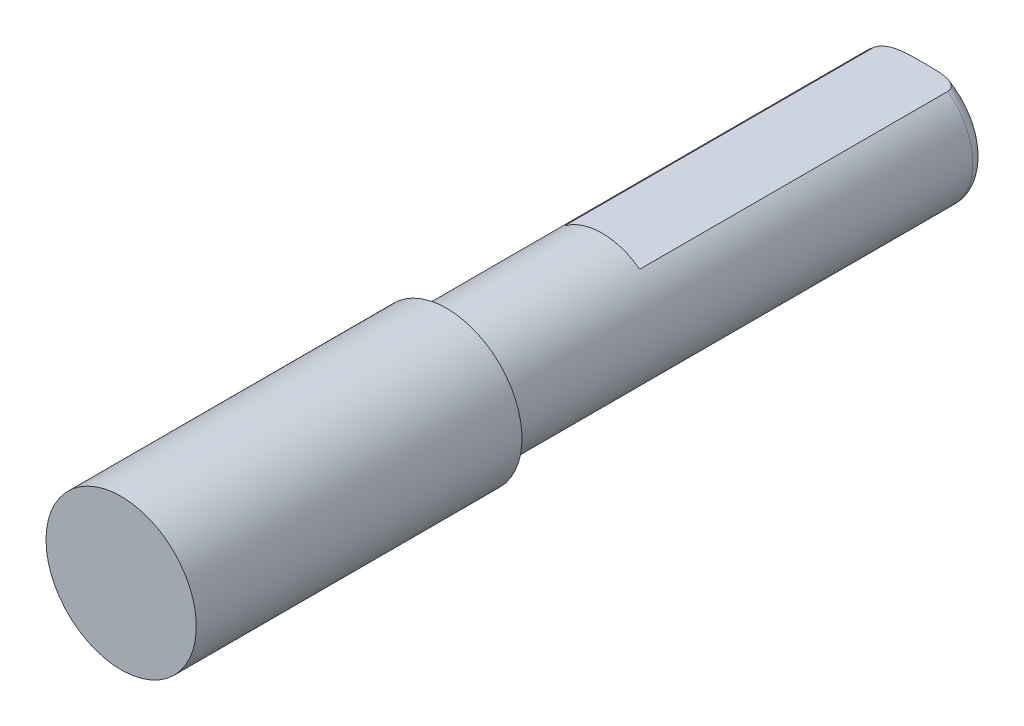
ISO-10303-21;
HEADER;
FILE_DESCRIPTION(('STEP AP214'),'2;1');
FILE_NAME('part.step','',(''),(''),'','','');
FILE_SCHEMA(('AUTOMOTIVE_DESIGN { 1 0 10303 214 1 1 1 1 }'));
ENDSEC;
DATA;
#1=APPLICATION_CONTEXT('core data for automotive mechanical design processes');
#2=APPLICATION_PROTOCOL_DEFINITION('international standard','automotive_design',2000,#1);
#3=PRODUCT_CONTEXT('',#1,'mechanical');
#4=PRODUCT('Part','Part','',(#3));
#5=PRODUCT_RELATED_PRODUCT_CATEGORY('part','',(#4));
#6=PRODUCT_DEFINITION_FORMATION('','',#4);
#7=PRODUCT_DEFINITION_CONTEXT('part definition',#1,'design');
#8=PRODUCT_DEFINITION('design','',#6,#7);
#9=PRODUCT_DEFINITION_SHAPE('','',#8);
#10=(LENGTH_UNIT() NAMED_UNIT(*) SI_UNIT(.MILLI.,.METRE.));
#11=(NAMED_UNIT(*) PLANE_ANGLE_UNIT() SI_UNIT($,.RADIAN.));
#12=(NAMED_UNIT(*) SI_UNIT($,.STERADIAN.) SOLID_ANGLE_UNIT());
#13=UNCERTAINTY_MEASURE_WITH_UNIT(LENGTH_MEASURE(1.E-05),#10,'distance_accuracy_value','');
#14=(GEOMETRIC_REPRESENTATION_CONTEXT(3) GLOBAL_UNCERTAINTY_ASSIGNED_CONTEXT((#13)) GLOBAL_UNIT_ASSIGNED_CONTEXT((#10,
#11,#12)) REPRESENTATION_CONTEXT('',''));
#15=CARTESIAN_POINT('',(0.,0.,0.));
#16=DIRECTION('',(0.,0.,1.));
#17=DIRECTION('',(1.,0.,0.));
#18=AXIS2_PLACEMENT_3D('',#15,#16,#17);
#19=CARTESIAN_POINT('',(0.,0.,19.));
#20=DIRECTION('',(0.,0.,-1.));
#21=DIRECTION('',(-1.,0.,0.));
#22=AXIS2_PLACEMENT_3D('',#19,#20,#21);
#23=CYLINDRICAL_SURFACE('',#22,2.5);
#24=CARTESIAN_POINT('',(0.,0.,19.));
#25=DIRECTION('',(0.,0.,1.));
#26=DIRECTION('',(1.,0.,0.));
#27=AXIS2_PLACEMENT_3D('',#24,#25,#26);
#28=CIRCLE('',#27,2.5);
#29=CARTESIAN_POINT('',(2.5,0.,19.));
#30=VERTEX_POINT('',#29);
#31=EDGE_CURVE('E85',#30,#30,#28,.T.);
#32=ORIENTED_EDGE('',*,*,#31,.F.);
#33=EDGE_LOOP('',(#32));
#34=FACE_BOUND('',#33,.T.);
#35=DIRECTION('',(0.,0.,-1.));
#36=VECTOR('',#35,1.);
#37=CARTESIAN_POINT('',(-1.5,2.,12.8));
#38=LINE('',#37,#36);
#39=CARTESIAN_POINT('',(-1.5,2.,12.8));
#40=VERTEX_POINT('',#39);
#41=CARTESIAN_POINT('',(-1.5,2.,0.5));
#42=VERTEX_POINT('',#41);
#43=EDGE_CURVE('E75',#40,#42,#38,.T.);
#44=ORIENTED_EDGE('',*,*,#43,.T.);
#45=CARTESIAN_POINT('',(0.,0.,0.5));
#46=DIRECTION('',(0.,0.,1.));
#47=DIRECTION('',(1.,0.,0.));
#48=AXIS2_PLACEMENT_3D('',#45,#46,#47);
#49=CIRCLE('',#48,2.5);
#50=CARTESIAN_POINT('',(1.5,2.,0.5));
#51=VERTEX_POINT('',#50);
#52=EDGE_CURVE('E77',#42,#51,#49,.T.);
#53=ORIENTED_EDGE('',*,*,#52,.T.);
#54=DIRECTION('',(0.,0.,-1.));
#55=VECTOR('',#54,1.);
#56=CARTESIAN_POINT('',(1.5,2.,12.8));
#57=LINE('',#56,#55);
#58=CARTESIAN_POINT('',(1.5,2.,12.8));
#59=VERTEX_POINT('',#58);
#60=EDGE_CURVE('E74',#59,#51,#57,.T.);
#61=ORIENTED_EDGE('',*,*,#60,.F.);
#62=CARTESIAN_POINT('',(0.,0.,12.8));
#63=DIRECTION('',(0.,0.,-1.));
#64=DIRECTION('',(-1.,0.,0.));
#65=AXIS2_PLACEMENT_3D('',#62,#63,#64);
#66=CIRCLE('',#65,2.5);
#67=EDGE_CURVE('E63',#40,#59,#66,.T.);
#68=ORIENTED_EDGE('',*,*,#67,.F.);
#69=EDGE_LOOP('',(#44,#53,#61,#68));
#70=FACE_BOUND('',#69,.T.);
#71=ADVANCED_FACE('F33',(#34,#70),#23,.T.);
#72=CARTESIAN_POINT('',(0.,0.,0.));
#73=DIRECTION('',(0.,0.,1.));
#74=DIRECTION('',(1.,0.,0.));
#75=AXIS2_PLACEMENT_3D('',#72,#73,#74);
#76=PLANE('',#75);
#77=CARTESIAN_POINT('',(0.,0.,0.));
#78=DIRECTION('',(0.,0.,1.));
#79=DIRECTION('',(1.,0.,0.));
#80=AXIS2_PLACEMENT_3D('',#77,#78,#79);
#81=CIRCLE('',#80,2.);
#82=CARTESIAN_POINT('',(0.,2.,0.));
#83=VERTEX_POINT('',#82);
#84=EDGE_CURVE('E11',#83,#83,#81,.F.);
#85=ORIENTED_EDGE('',*,*,#84,.T.);
#86=EDGE_LOOP('',(#85));
#87=FACE_BOUND('',#86,.T.);
#88=ADVANCED_FACE('F112',(#87),#76,.F.);
#89=CARTESIAN_POINT('',(0.,0.,19.));
#90=DIRECTION('',(0.,0.,1.));
#91=DIRECTION('',(1.,0.,0.));
#92=AXIS2_PLACEMENT_3D('',#89,#90,#91);
#93=PLANE('',#92);
#94=CARTESIAN_POINT('',(0.,0.,19.));
#95=DIRECTION('',(0.,0.,1.));
#96=DIRECTION('',(1.,0.,0.));
#97=AXIS2_PLACEMENT_3D('',#94,#95,#96);
#98=CIRCLE('',#97,3.);
#99=CARTESIAN_POINT('',(-3.,0.,19.));
#100=VERTEX_POINT('',#99);
#101=EDGE_CURVE('E79',#100,#100,#98,.T.);
#102=ORIENTED_EDGE('',*,*,#101,.F.);
#103=EDGE_LOOP('',(#102));
#104=FACE_BOUND('',#103,.T.);
#105=ORIENTED_EDGE('',*,*,#31,.T.);
#106=EDGE_LOOP('',(#105));
#107=FACE_BOUND('',#106,.T.);
#108=ADVANCED_FACE('F109',(#104,#107),#93,.F.);
#109=CARTESIAN_POINT('',(0.,0.,32.));
#110=DIRECTION('',(0.,0.,-1.));
#111=DIRECTION('',(-1.,0.,0.));
#112=AXIS2_PLACEMENT_3D('',#109,#110,#111);
#113=CYLINDRICAL_SURFACE('',#112,3.);
#114=CARTESIAN_POINT('',(0.,0.,32.));
#115=DIRECTION('',(0.,0.,1.));
#116=DIRECTION('',(1.,0.,0.));
#117=AXIS2_PLACEMENT_3D('',#114,#115,#116);
#118=CIRCLE('',#117,3.);
#119=CARTESIAN_POINT('',(-3.,0.,32.));
#120=VERTEX_POINT('',#119);
#121=EDGE_CURVE('E82',#120,#120,#118,.T.);
#122=CARTESIAN_POINT('',(-3.,0.,32.));
#123=CARTESIAN_POINT('',(-3.,0.,31.8645833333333));
#124=CARTESIAN_POINT('',(-3.,0.,31.7291666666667));
#125=CARTESIAN_POINT('',(-3.,0.,31.4583333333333));
#126=CARTESIAN_POINT('',(-3.,0.,31.3229166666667));
#127=CARTESIAN_POINT('',(-3.,0.,31.0520833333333));
#128=CARTESIAN_POINT('',(-3.,0.,30.9166666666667));
#129=CARTESIAN_POINT('',(-3.,0.,30.6458333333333));
#130=CARTESIAN_POINT('',(-3.,0.,30.5104166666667));
#131=CARTESIAN_POINT('',(-3.,0.,30.2395833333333));
#132=CARTESIAN_POINT('',(-3.,0.,30.1041666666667));
#133=CARTESIAN_POINT('',(-3.,0.,29.8333333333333));
#134=CARTESIAN_POINT('',(-3.,0.,29.6979166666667));
#135=CARTESIAN_POINT('',(-3.,0.,29.4270833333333));
#136=CARTESIAN_POINT('',(-3.,0.,29.2916666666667));
#137=CARTESIAN_POINT('',(-3.,0.,29.0208333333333));
#138=CARTESIAN_POINT('',(-3.,0.,28.8854166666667));
#139=CARTESIAN_POINT('',(-3.,0.,28.6145833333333));
#140=CARTESIAN_POINT('',(-3.,0.,28.4791666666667));
#141=CARTESIAN_POINT('',(-3.,0.,28.2083333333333));
#142=CARTESIAN_POINT('',(-3.,0.,28.0729166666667));
#143=CARTESIAN_POINT('',(-3.,0.,27.8020833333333));
#144=CARTESIAN_POINT('',(-3.,0.,27.6666666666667));
#145=CARTESIAN_POINT('',(-3.,0.,27.3958333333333));
#146=CARTESIAN_POINT('',(-3.,0.,27.2604166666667));
#147=CARTESIAN_POINT('',(-3.,0.,26.9895833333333));
#148=CARTESIAN_POINT('',(-3.,0.,26.8541666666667));
#149=CARTESIAN_POINT('',(-3.,0.,26.5833333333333));
#150=CARTESIAN_POINT('',(-3.,0.,26.4479166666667));
#151=CARTESIAN_POINT('',(-3.,0.,26.1770833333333));
#152=CARTESIAN_POINT('',(-3.,0.,26.0416666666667));
#153=CARTESIAN_POINT('',(-3.,0.,25.7708333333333));
#154=CARTESIAN_POINT('',(-3.,0.,25.6354166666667));
#155=CARTESIAN_POINT('',(-3.,0.,25.3645833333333));
#156=CARTESIAN_POINT('',(-3.,0.,25.2291666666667));
#157=CARTESIAN_POINT('',(-3.,0.,24.9583333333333));
#158=CARTESIAN_POINT('',(-3.,0.,24.8229166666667));
#159=CARTESIAN_POINT('',(-3.,0.,24.5520833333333));
#160=CARTESIAN_POINT('',(-3.,0.,24.4166666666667));
#161=CARTESIAN_POINT('',(-3.,0.,24.1458333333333));
#162=CARTESIAN_POINT('',(-3.,0.,24.0104166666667));
#163=CARTESIAN_POINT('',(-3.,0.,23.7395833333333));
#164=CARTESIAN_POINT('',(-3.,0.,23.6041666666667));
#165=CARTESIAN_POINT('',(-3.,0.,23.3333333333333));
#166=CARTESIAN_POINT('',(-3.,0.,23.1979166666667));
#167=CARTESIAN_POINT('',(-3.,0.,22.9270833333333));
#168=CARTESIAN_POINT('',(-3.,0.,22.7916666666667));
#169=CARTESIAN_POINT('',(-3.,0.,22.5208333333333));
#170=CARTESIAN_POINT('',(-3.,0.,22.3854166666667));
#171=CARTESIAN_POINT('',(-3.,0.,22.1145833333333));
#172=CARTESIAN_POINT('',(-3.,0.,21.9791666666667));
#173=CARTESIAN_POINT('',(-3.,0.,21.7083333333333));
#174=CARTESIAN_POINT('',(-3.,0.,21.5729166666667));
#175=CARTESIAN_POINT('',(-3.,0.,21.3020833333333));
#176=CARTESIAN_POINT('',(-3.,0.,21.1666666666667));
#177=CARTESIAN_POINT('',(-3.,0.,20.8958333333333));
#178=CARTESIAN_POINT('',(-3.,0.,20.7604166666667));
#179=CARTESIAN_POINT('',(-3.,0.,20.4895833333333));
#180=CARTESIAN_POINT('',(-3.,0.,20.3541666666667));
#181=CARTESIAN_POINT('',(-3.,0.,20.0833333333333));
#182=CARTESIAN_POINT('',(-3.,0.,19.9479166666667));
#183=CARTESIAN_POINT('',(-3.,0.,19.6770833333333));
#184=CARTESIAN_POINT('',(-3.,0.,19.5416666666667));
#185=CARTESIAN_POINT('',(-3.,0.,19.2708333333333));
#186=CARTESIAN_POINT('',(-3.,0.,19.1354166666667));
#187=CARTESIAN_POINT('',(-3.,0.,19.));
#188=B_SPLINE_CURVE_WITH_KNOTS('',3,(#122,#123,#124,#125,#126,#127,#128,#129,#130,#131,#132,
#133,#134,#135,#136,#137,#138,#139,#140,#141,#142,#143,#144,#145,#146,#147,#148,#149,#150,#151,
#152,#153,#154,#155,#156,#157,#158,#159,#160,#161,#162,#163,#164,#165,#166,#167,#168,#169,#170,
#171,#172,#173,#174,#175,#176,#177,#178,#179,#180,#181,#182,#183,#184,#185,#186,#187),
.UNSPECIFIED.,.F.,.F.,(4,2,2,2,2,2,2,2,2,2,2,2,2,2,2,2,2,2,2,2,2,2,2,2,2,2,2,2,2,2,2,2,4),(0.,
0.406250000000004,0.812500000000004,1.21875,1.625,2.03125,2.4375,2.84375,3.25,3.65625,4.0625,
4.46875,4.875,5.28125,5.68750000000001,6.09375,6.5,6.90625,7.3125,7.71875,8.125,8.53125,8.9375,
9.34375000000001,9.75,10.15625,10.5625,10.96875,11.375,11.78125,12.1875,12.59375,13.),.UNSPECIFIED.);
#189=EDGE_CURVE('BSEAM107',#120,#100,#188,.T.);
#190=ORIENTED_EDGE('',*,*,#121,.F.);
#191=ORIENTED_EDGE('',*,*,#101,.T.);
#192=ORIENTED_EDGE('',*,*,#189,.T.);
#193=ORIENTED_EDGE('',*,*,#189,.F.);
#194=EDGE_LOOP('',(#190,#192,#191,#193));
#195=FACE_BOUND('',#194,.T.);
#196=ADVANCED_FACE('F107',(#195),#113,.T.);
#197=CARTESIAN_POINT('',(0.,0.,32.));
#198=DIRECTION('',(0.,0.,1.));
#199=DIRECTION('',(1.,0.,0.));
#200=AXIS2_PLACEMENT_3D('',#197,#198,#199);
#201=PLANE('',#200);
#202=ORIENTED_EDGE('',*,*,#121,.T.);
#203=EDGE_LOOP('',(#202));
#204=FACE_BOUND('',#203,.T.);
#205=ADVANCED_FACE('F103',(#204),#201,.T.);
#206=CARTESIAN_POINT('',(1.5,2.,12.8));
#207=DIRECTION('',(0.,-1.,0.));
#208=DIRECTION('',(0.,0.,-1.));
#209=AXIS2_PLACEMENT_3D('',#206,#207,#208);
#210=PLANE('',#209);
#211=ORIENTED_EDGE('',*,*,#60,.T.);
#212=CARTESIAN_POINT('',(1.5,2.,0.5));
#213=CARTESIAN_POINT('',(1.50005508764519,2.,0.479993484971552));
#214=CARTESIAN_POINT('',(1.49800297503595,2.,0.460049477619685));
#215=CARTESIAN_POINT('',(1.49017103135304,2.,0.421109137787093));
#216=CARTESIAN_POINT('',(1.48442943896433,2.,0.402105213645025));
#217=CARTESIAN_POINT('',(1.46971395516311,2.,0.36549928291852));
#218=CARTESIAN_POINT('',(1.46075157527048,2.,0.347892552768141));
#219=CARTESIAN_POINT('',(1.44018960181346,2.,0.314258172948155));
#220=CARTESIAN_POINT('',(1.42858295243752,2.,0.298234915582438));
#221=CARTESIAN_POINT('',(1.39760924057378,2.,0.261066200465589));
#222=CARTESIAN_POINT('',(1.37710380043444,2.,0.240872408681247));
#223=CARTESIAN_POINT('',(1.3332153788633,2.,0.20398062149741));
#224=CARTESIAN_POINT('',(1.30982929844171,2.,0.187286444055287));
#225=CARTESIAN_POINT('',(1.24588475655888,2.,0.147473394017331));
#226=CARTESIAN_POINT('',(1.20375339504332,2.,0.126889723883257));
#227=CARTESIAN_POINT('',(1.13857481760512,2.,0.100734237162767));
#228=CARTESIAN_POINT('',(1.11639476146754,2.,0.0927728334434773));
#229=CARTESIAN_POINT('',(1.07158652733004,2.,0.078265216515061));
#230=CARTESIAN_POINT('',(1.04895868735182,2.,0.0717179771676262));
#231=CARTESIAN_POINT('',(0.982989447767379,2.,0.0545224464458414));
#232=CARTESIAN_POINT('',(0.939240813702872,2.,0.0454505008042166));
#233=CARTESIAN_POINT('',(0.851180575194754,2.,0.0305610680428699));
#234=CARTESIAN_POINT('',(0.806868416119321,2.,0.0247470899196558));
#235=CARTESIAN_POINT('',(0.717748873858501,2.,0.0154595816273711));
#236=CARTESIAN_POINT('',(0.672940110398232,2.,0.0119999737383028));
#237=CARTESIAN_POINT('',(0.58322412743,2.,0.00672393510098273));
#238=CARTESIAN_POINT('',(0.538316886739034,2.,0.00490790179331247));
#239=CARTESIAN_POINT('',(0.452027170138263,2.,0.00241155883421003));
#240=CARTESIAN_POINT('',(0.410646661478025,2.,0.00165282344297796));
#241=CARTESIAN_POINT('',(0.327877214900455,2.,0.000635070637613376));
#242=CARTESIAN_POINT('',(0.286488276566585,2.,0.00037609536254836));
#243=CARTESIAN_POINT('',(0.204245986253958,2.,7.37240462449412E-05));
#244=CARTESIAN_POINT('',(0.163392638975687,2.,2.75798734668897E-05));
#245=CARTESIAN_POINT('',(0.0816928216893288,2.,5.54583589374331E-07));
#246=CARTESIAN_POINT('',(0.0408463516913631,2.,1.96623861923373E-05));
#247=CARTESIAN_POINT('',(0.,2.,0.));
#248=B_SPLINE_CURVE_WITH_KNOTS('',3,(#212,#213,#214,#215,#216,#217,#218,#219,#220,#221,#222,
#223,#224,#225,#226,#227,#228,#229,#230,#231,#232,#233,#234,#235,#236,#237,#238,#239,#240,#241,
#242,#243,#244,#245,#246,#247),.UNSPECIFIED.,.F.,.F.,(4,2,2,2,2,2,2,2,2,2,2,2,2,2,2,2,2,4),(0.,
0.059815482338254,0.119020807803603,0.178016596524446,0.237171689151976,0.32302240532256,
0.408966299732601,0.548800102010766,0.61947446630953,0.69009737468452,0.823948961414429,
0.957944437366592,1.092725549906,1.2275392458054,1.35169671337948,1.47586464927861,
1.59842472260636,1.72096398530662),.UNSPECIFIED.);
#249=EDGE_CURVE('E42',#51,#83,#248,.T.);
#250=ORIENTED_EDGE('',*,*,#249,.T.);
#251=CARTESIAN_POINT('',(0.,2.,0.));
#252=CARTESIAN_POINT('',(-0.0407626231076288,2.,1.95157159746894E-05));
#253=CARTESIAN_POINT('',(-0.0815253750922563,2.,5.56610073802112E-07));
#254=CARTESIAN_POINT('',(-0.163057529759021,2.,2.73480300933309E-05));
#255=CARTESIAN_POINT('',(-0.203826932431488,2.,7.3109207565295E-05));
#256=CARTESIAN_POINT('',(-0.285823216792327,2.,0.000372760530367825));
#257=CARTESIAN_POINT('',(-0.327050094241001,2.,0.000628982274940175));
#258=CARTESIAN_POINT('',(-0.409495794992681,2.,0.00163467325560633));
#259=CARTESIAN_POINT('',(-0.450714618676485,2.,0.00238410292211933));
#260=CARTESIAN_POINT('',(-0.534687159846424,2.,0.00479235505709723));
#261=CARTESIAN_POINT('',(-0.577440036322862,2.,0.00648446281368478));
#262=CARTESIAN_POINT('',(-0.662861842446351,2.,0.0113237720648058));
#263=CARTESIAN_POINT('',(-0.705530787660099,2.,0.0144706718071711));
#264=CARTESIAN_POINT('',(-0.790467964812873,2.,0.0228370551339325));
#265=CARTESIAN_POINT('',(-0.832737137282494,2.,0.0280465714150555));
#266=CARTESIAN_POINT('',(-0.916821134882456,2.,0.0412934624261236));
#267=CARTESIAN_POINT('',(-0.958636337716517,2.,0.0493282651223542));
#268=CARTESIAN_POINT('',(-1.01633423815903,2.,0.0631500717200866));
#269=CARTESIAN_POINT('',(-1.0325980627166,2.,0.0673552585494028));
#270=CARTESIAN_POINT('',(-1.06494846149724,2.,0.0764196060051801));
#271=CARTESIAN_POINT('',(-1.08103496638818,2.,0.0812790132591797));
#272=CARTESIAN_POINT('',(-1.12889043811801,2.,0.0969233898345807));
#273=CARTESIAN_POINT('',(-1.16032087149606,2.,0.108789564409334));
#274=CARTESIAN_POINT('',(-1.22193787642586,2.,0.136152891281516));
#275=CARTESIAN_POINT('',(-1.25211017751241,2.,0.15168275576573));
#276=CARTESIAN_POINT('',(-1.30987180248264,2.,0.187028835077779));
#277=CARTESIAN_POINT('',(-1.33746517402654,2.,0.206838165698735));
#278=CARTESIAN_POINT('',(-1.37963467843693,2.,0.243677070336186));
#279=CARTESIAN_POINT('',(-1.39542133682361,2.,0.259314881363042));
#280=CARTESIAN_POINT('',(-1.4245077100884,2.,0.292773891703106));
#281=CARTESIAN_POINT('',(-1.43780974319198,2.,0.310593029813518));
#282=CARTESIAN_POINT('',(-1.45935751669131,2.,0.345436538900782));
#283=CARTESIAN_POINT('',(-1.46806350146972,2.,0.362174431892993));
#284=CARTESIAN_POINT('',(-1.48256312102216,2.,0.396856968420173));
#285=CARTESIAN_POINT('',(-1.48836281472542,2.,0.414799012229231));
#286=CARTESIAN_POINT('',(-1.49497096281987,2.,0.444066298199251));
#287=CARTESIAN_POINT('',(-1.49684839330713,2.,0.455157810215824));
#288=CARTESIAN_POINT('',(-1.49936626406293,2.,0.477496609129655));
#289=CARTESIAN_POINT('',(-1.5000048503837,2.,0.488744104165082));
#290=CARTESIAN_POINT('',(-1.5,2.,0.5));
#291=B_SPLINE_CURVE_WITH_KNOTS('',3,(#251,#252,#253,#254,#255,#256,#257,#258,#259,#260,#261,
#262,#263,#264,#265,#266,#267,#268,#269,#270,#271,#272,#273,#274,#275,#276,#277,#278,#279,#280,
#281,#282,#283,#284,#285,#286,#287,#288,#289,#290),.UNSPECIFIED.,.F.,.F.,(4,2,2,2,2,2,2,2,2,2,2,
2,2,2,2,2,2,2,2,4),(0.,0.122288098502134,0.244596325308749,0.368278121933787,0.491949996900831,
0.620293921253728,0.74861123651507,0.876315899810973,1.00390460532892,1.05428854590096,
1.10469153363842,1.20529649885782,1.30683621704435,1.4082137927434,1.47468160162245,
1.54108708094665,1.5974625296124,1.65371995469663,1.68740390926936,1.72113823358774),.UNSPECIFIED.);
#292=EDGE_CURVE('E91',#83,#42,#291,.T.);
#293=ORIENTED_EDGE('',*,*,#292,.T.);
#294=ORIENTED_EDGE('',*,*,#43,.F.);
#295=DIRECTION('',(-1.,0.,0.));
#296=VECTOR('',#295,1.);
#297=CARTESIAN_POINT('',(1.5,2.,12.8));
#298=LINE('',#297,#296);
#299=EDGE_CURVE('E66',#59,#40,#298,.T.);
#300=ORIENTED_EDGE('',*,*,#299,.F.);
#301=EDGE_LOOP('',(#211,#250,#293,#294,#300));
#302=FACE_BOUND('',#301,.T.);
#303=ADVANCED_FACE('F73',(#302),#210,.F.);
#304=CARTESIAN_POINT('',(0.,0.,12.8));
#305=DIRECTION('',(0.,0.,-1.));
#306=DIRECTION('',(-1.,0.,0.));
#307=AXIS2_PLACEMENT_3D('',#304,#305,#306);
#308=PLANE('',#307);
#309=ORIENTED_EDGE('',*,*,#67,.T.);
#310=ORIENTED_EDGE('',*,*,#299,.T.);
#311=EDGE_LOOP('',(#309,#310));
#312=FACE_BOUND('',#311,.T.);
#313=ADVANCED_FACE('F65',(#312),#308,.T.);
#314=CARTESIAN_POINT('',(0.,0.,0.5));
#315=DIRECTION('',(0.,0.,1.));
#316=DIRECTION('',(1.,0.,0.));
#317=AXIS2_PLACEMENT_3D('',#314,#315,#316);
#318=TOROIDAL_SURFACE('',#317,2.,0.5);
#319=ORIENTED_EDGE('',*,*,#292,.F.);
#320=ORIENTED_EDGE('',*,*,#84,.F.);
#321=ORIENTED_EDGE('',*,*,#249,.F.);
#322=ORIENTED_EDGE('',*,*,#52,.F.);
#323=EDGE_LOOP('',(#319,#320,#321,#322));
#324=FACE_BOUND('',#323,.T.);
#325=ADVANCED_FACE('F35',(#324),#318,.T.);
#326=CLOSED_SHELL('',(#71,#88,#108,#196,#205,#303,#313,#325));
#327=MANIFOLD_SOLID_BREP('B2',#326);
#328=ADVANCED_BREP_SHAPE_REPRESENTATION('',(#18,#327),#14);
#329=SHAPE_DEFINITION_REPRESENTATION(#9,#328);
ENDSEC;
END-ISO-10303-21;
